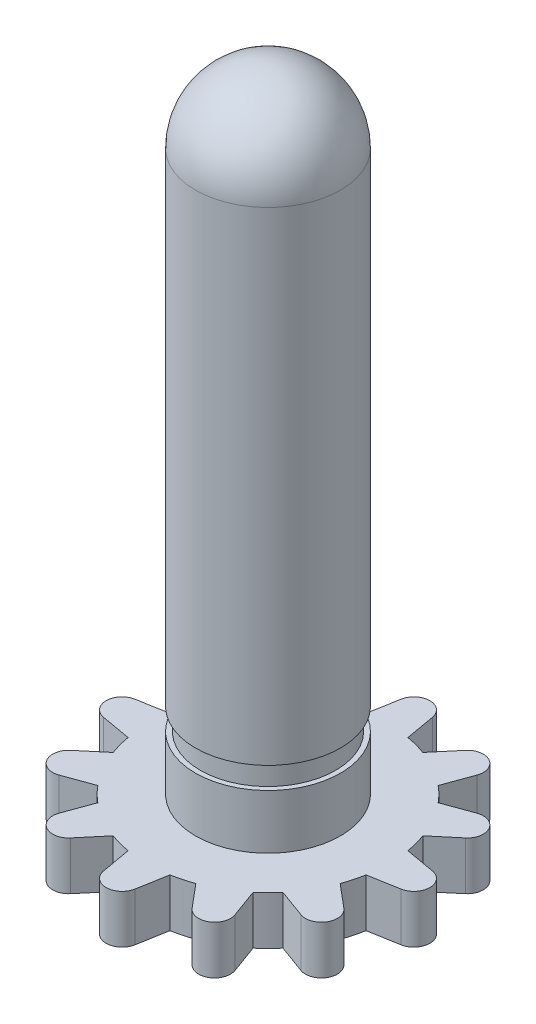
from build123d import *

# Parameters (mm, degrees)
SKETCH1_R           = 5
BOSS_EXTRUDE1_DEPTH = 2
BOSS_EXTRUDE2_DEPTH = 2
CIRPATTERN1_COUNT   = 12
SKETCH4_R           = 3
BOSS_EXTRUDE3_DEPTH = 2.25
SKETCH5_R           = 2.8
BOSS_EXTRUDE4_DEPTH = 0.9
SKETCH6_R           = 3
BOSS_EXTRUDE5_DEPTH = 20
DOME1_FACE_RADIUS   = 3
DOME1_HEIGHT        = 3


with BuildPart() as part:
    # Sketch1 → Boss-Extrude1 (new body)
    with BuildSketch(Plane(origin=(0, 0, 0), x_dir=(1, 0, 0), z_dir=(0, 1, 0))):
        with Locations(Location((0, 0, 0), (0, 0, 270))):
            Circle(SKETCH1_R)
    extrude(amount=BOSS_EXTRUDE1_DEPTH)

    # Sketch2 → Boss-Extrude2 (add)
    with BuildSketch(Plane(origin=(0, 0, 0), x_dir=(1, 0, 0), z_dir=(0, 1, 0))):
        with BuildLine():
            Line((-0.86693807, 4.924268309), (0.86693807, 4.924268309))
            Line((0.86693807, 4.924268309), (0.65, 6.15458524))
            ThreePointArc((0.65, 6.15458524), (0, 6.7), (-0.65, 6.15458524))
            Line((-0.65, 6.15458524), (-0.86693807, 4.924268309))
        make_face()
    boss_extrude2 = extrude(amount=BOSS_EXTRUDE2_DEPTH)

    # CirPattern1: Boss-Extrude2 ×12 about axis
    cirpattern1_axis = Axis((0, 0, 0), (0, 1, 0))
    for i in range(1, CIRPATTERN1_COUNT):
        add(boss_extrude2.rotate(cirpattern1_axis, i * 360 / CIRPATTERN1_COUNT))

    # Sketch4 → Boss-Extrude3 (add)
    with BuildSketch(Plane(origin=(0, 2, 0), x_dir=(1, 0, 0), z_dir=(0, 1, 0))):
        with Locations(Location((0, 0, 0), (0, 0, 270))):
            Circle(SKETCH4_R)
    extrude(amount=BOSS_EXTRUDE3_DEPTH)

    # Sketch5 → Boss-Extrude4 (add)
    with BuildSketch(Plane(origin=(0, 4.25, 0), x_dir=(1, 0, 0), z_dir=(0, 1, 0))):
        with Locations(Location((0, 0, 0), (0, 0, 270))):
            Circle(SKETCH5_R)
    extrude(amount=BOSS_EXTRUDE4_DEPTH)

    # Sketch6 → Boss-Extrude5 (add)
    with BuildSketch(Plane(origin=(0, 5.15, 0), x_dir=(1, 0, 0), z_dir=(0, 1, 0))):
        with Locations(Location((0, 0, 0), (0, 0, 270))):
            Circle(SKETCH6_R)
    extrude(amount=BOSS_EXTRUDE5_DEPTH)

    # Dome1: a dome of height H over a round flat face of radius A is a cap of a sphere of radius (A * A + H * H) / (2 * H)
    dome1_r = (DOME1_FACE_RADIUS * DOME1_FACE_RADIUS + DOME1_HEIGHT * DOME1_HEIGHT) / (2 * DOME1_HEIGHT)
    dome1_base = Plane((0, 25.15, 0), z_dir=(0, 1, 0))
    with Locations(dome1_base.offset(DOME1_HEIGHT - dome1_r)):
        dome1_ball = Sphere(dome1_r, mode=Mode.PRIVATE)
    add(split(dome1_ball, bisect_by=dome1_base, keep=Keep.TOP, mode=Mode.PRIVATE))


solid = part.part
